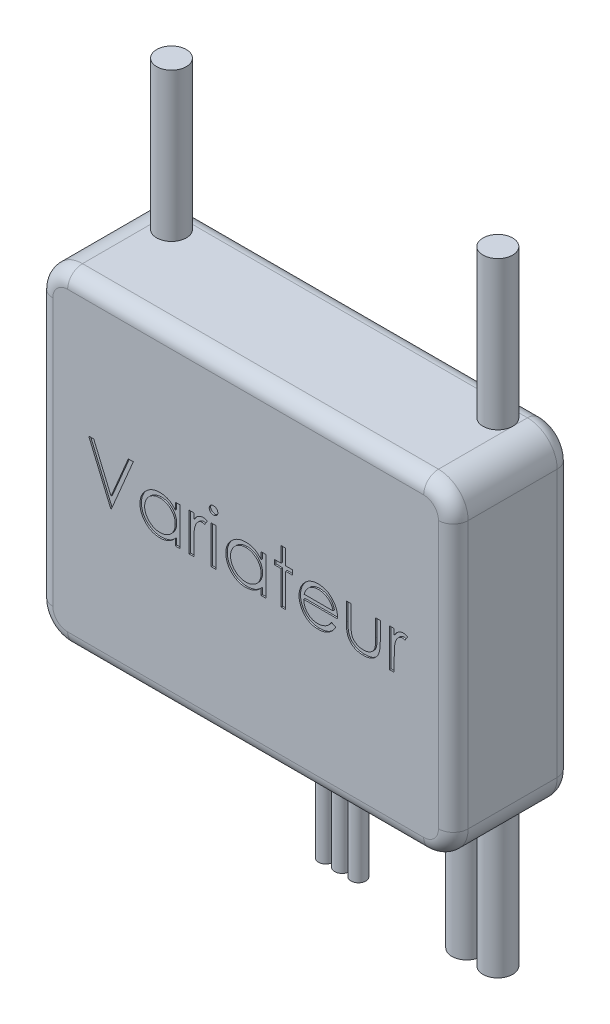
from build123d import *

# Parameters (mm, degrees)
EXTRUSION1_DEPTH        = 8
CONG_1_R                = 1
ESQUISSE2_W             = 0.314102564
ESQUISSE2_H             = 2.557692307
ENL_V_MAT_EXTRU_1_DEPTH = 0.1
ESQUISSE3_R             = 1
ESQUISSE3_R_2           = 0.5
EXTRUSION2_DEPTH        = 10
EXTRUSION3_START        = 10
ESQUISSE4_R             = 1
EXTRUSION3_DEPTH        = 10


with BuildPart() as part:
    # Esquisse1 → Extrusion1 (new body)
    with BuildSketch(Plane.XY):
        with BuildLine():
            Line((-12, 11), (12, 11))
            ThreePointArc((12, 11), (13.414213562, 10.414213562), (14, 9))
            Line((14, 9), (14, -9))
            ThreePointArc((14, -9), (13.414213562, -10.414213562), (12, -11))
            Line((12, -11), (-12, -11))
            ThreePointArc((-12, -11), (-13.414213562, -10.414213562), (-14, -9))
            Line((-14, -9), (-14, 9))
            ThreePointArc((-14, 9), (-13.414213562, 10.414213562), (-12, 11))
        make_face()
    extrude(amount=EXTRUSION1_DEPTH)

    # Cong_1
    cong_1_edges = [part.edges().sort_by_distance(p)[0] for p in [
        (-13.414213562, -10.414213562, 8),
        (0, -11, 8),
        (13.414213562, -10.414213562, 8),
        (14, 0, 8),
        (13.414213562, 10.414213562, 8),
        (0, 11, 8),
        (-13.414213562, 10.414213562, 8),
        (0, 11, 0),
        (-14, 0, 8),
        (13.414213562, 10.414213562, 0),
        (14, 0, 0),
        (13.414213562, -10.414213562, 0),
        (0, -11, 0),
        (-13.414213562, -10.414213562, 0),
        (-14, 0, 0),
        (-13.414213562, 10.414213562, 0),
    ]]
    fillet(cong_1_edges, radius=CONG_1_R)

    # Esquisse2 → Enl_v. mat.-Extru.1 (cut)
    # profile 1 of 10: a face of its own
    with BuildSketch(Plane.XY.offset(8)):
        Polygon((-10.58037848, 2.145396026), (-10.243840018, 2.145396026), (-9.077173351, -0.612817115), (-7.910506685, 2.145396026), (-7.573968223, 2.145396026), (-9.054737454, -1.354603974), (-9.099609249, -1.354603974), align=None)
    # profile 2 of 10: a face of its own
    with BuildSketch(Plane.XY.offset(8)):
        with BuildLine():
            Line((-4.432942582, 1.203088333), (-4.432942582, -1.354603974))
            Line((-4.432942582, -1.354603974), (-4.747045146, -1.354603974))
            Line((-4.747045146, -1.354603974), (-4.747045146, -0.912196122))
            add(Edge.make_bspline(
                [(-4.747045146, -0.912196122), (-4.782463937, -0.952235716), (-4.851584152, -1.030373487), (-4.96702527, -1.132455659), (-5.089393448, -1.216833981), (-5.218094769, -1.284983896), (-5.353013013, -1.336175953), (-5.4938491, -1.372562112), (-5.640660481, -1.395955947), (-5.740912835, -1.398291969), (-5.791716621, -1.399475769)],
                knots=[0, 0, 0, 0, 1.074387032, 2.096679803, 3.090159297, 4.057316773, 5.018401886, 5.985159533, 6.978961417, 8, 8, 8, 8], degree=3))
            add(Edge.make_bspline(
                [(-5.791716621, -1.399475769), (-5.836884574, -1.398249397), (-5.925957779, -1.395830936), (-6.056986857, -1.377068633), (-6.183079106, -1.346938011), (-6.304353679, -1.305037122), (-6.420025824, -1.2494563), (-6.531085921, -1.182915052), (-6.636958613, -1.103674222), (-6.736030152, -1.013086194), (-6.827262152, -0.914691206), (-6.907323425, -0.80974566), (-6.974076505, -0.698703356), (-7.029896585, -0.582970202), (-7.07289293, -0.461655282), (-7.102866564, -0.335178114), (-7.121607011, -0.203688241), (-7.124024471, -0.114148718), (-7.125250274, -0.068746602)],
                knots=[0, 0, 0, 0, 1.033919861, 2.038935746, 3.024066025, 3.998881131, 4.97069526, 5.957263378, 6.95902576, 7.993208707, 9.027059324, 10.027763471, 11.009749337, 11.988697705, 12.965288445, 13.950418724, 14.960734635, 16, 16, 16, 16], degree=3))
            add(Edge.make_bspline(
                [(-7.125250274, -0.068746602), (-7.123997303, -0.024282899), (-7.121520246, 0.063619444), (-7.103067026, 0.192898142), (-7.072036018, 0.317416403), (-7.02848817, 0.436773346), (-6.972646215, 0.551113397), (-6.904718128, 0.660517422), (-6.824699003, 0.765286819), (-6.732446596, 0.862958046), (-6.632511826, 0.95317866), (-6.525603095, 1.031587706), (-6.414379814, 1.099304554), (-6.297116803, 1.152958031), (-6.175549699, 1.196367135), (-6.048596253, 1.226400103), (-5.916784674, 1.244097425), (-5.827294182, 1.246660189), (-5.781900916, 1.247960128)],
                knots=[0, 0, 0, 0, 1.020392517, 2.01726096, 2.990465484, 3.961182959, 4.928053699, 5.906110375, 6.912531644, 7.948652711, 8.985773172, 9.998621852, 10.987621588, 11.969261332, 12.953316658, 13.946091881, 14.958173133, 16, 16, 16, 16], degree=3))
            add(Edge.make_bspline(
                [(-5.781900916, 1.247960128), (-5.729701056, 1.246522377), (-5.627339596, 1.243703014), (-5.477611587, 1.220240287), (-5.335967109, 1.180601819), (-5.201312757, 1.126684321), (-5.074132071, 1.055035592), (-4.955629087, 0.964655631), (-4.844563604, 0.856114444), (-4.780183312, 0.772744), (-4.747045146, 0.729831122)],
                knots=[0, 0, 0, 0, 1.038897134, 2.037228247, 3.008116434, 3.962042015, 4.918381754, 5.904844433, 6.921570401, 8, 8, 8, 8], degree=3))
            Line((-4.747045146, 0.729831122), (-4.747045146, 1.203088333))
            Line((-4.747045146, 1.203088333), (-4.432942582, 1.203088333))
        make_face()
        with BuildLine():
            add(Edge.make_bspline(
                [(-5.777694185, 0.933857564), (-5.823608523, 0.932223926), (-5.914236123, 0.928999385), (-6.047280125, 0.90382589), (-6.174593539, 0.861941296), (-6.295539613, 0.804659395), (-6.40820783, 0.732630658), (-6.5089015, 0.645509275), (-6.598444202, 0.545672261), (-6.673752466, 0.43357015), (-6.735142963, 0.313392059), (-6.778309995, 0.187767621), (-6.806779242, 0.058962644), (-6.809687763, -0.028400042), (-6.81114771, -0.072252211)],
                knots=[0, 0, 0, 0, 1.031046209, 2.035121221, 3.029706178, 4.034933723, 5.034054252, 6.02443088, 7.017295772, 8.038157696, 9.050218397, 10.03989886, 11.016116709, 12, 12, 12, 12], degree=3))
            add(Edge.make_bspline(
                [(-6.81114771, -0.072252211), (-6.809282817, -0.115842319), (-6.80556034, -0.202851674), (-6.778809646, -0.331832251), (-6.733929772, -0.457486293), (-6.67268771, -0.578747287), (-6.596001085, -0.691331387), (-6.507112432, -0.79307151), (-6.405162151, -0.880561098), (-6.292234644, -0.953798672), (-6.171626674, -1.012961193), (-6.044792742, -1.054126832), (-5.914117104, -1.080704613), (-5.82526477, -1.083809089), (-5.780498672, -1.085373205)],
                knots=[0, 0, 0, 0, 0.979072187, 1.954306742, 2.945804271, 3.96968567, 4.997920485, 5.998718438, 6.996577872, 8.005894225, 9.015743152, 10.005417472, 10.995077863, 12, 12, 12, 12], degree=3))
            add(Edge.make_bspline(
                [(-5.780498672, -1.085373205), (-5.735052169, -1.083713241), (-5.644663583, -1.080411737), (-5.511224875, -1.055130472), (-5.381729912, -1.013361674), (-5.257942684, -0.955462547), (-5.142626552, -0.883705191), (-5.039128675, -0.7996981), (-4.951612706, -0.701994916), (-4.877420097, -0.594618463), (-4.81924468, -0.476906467), (-4.776868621, -0.351572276), (-4.751814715, -0.218611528), (-4.748656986, -0.127747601), (-4.747045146, -0.081366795)],
                knots=[0, 0, 0, 0, 1.01762866, 2.023962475, 3.030623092, 4.058876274, 5.077231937, 6.066672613, 7.034107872, 8.005628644, 8.981990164, 9.965428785, 10.961468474, 12, 12, 12, 12], degree=3))
            add(Edge.make_bspline(
                [(-4.747045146, -0.081366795), (-4.748004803, -0.046028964), (-4.74989371, 0.023527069), (-4.76432428, 0.125654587), (-4.787279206, 0.223388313), (-4.819625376, 0.316831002), (-4.86211666, 0.405466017), (-4.913364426, 0.489929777), (-4.974269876, 0.569782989), (-5.043852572, 0.64392606), (-5.120017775, 0.711552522), (-5.200612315, 0.771916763), (-5.286591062, 0.821505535), (-5.376508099, 0.862546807), (-5.470519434, 0.895205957), (-5.569390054, 0.916993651), (-5.67206904, 0.931953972), (-5.742115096, 0.933216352), (-5.777694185, 0.933857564)],
                knots=[0, 0, 0, 0, 1.050140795, 2.067009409, 3.05949893, 4.030605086, 5.00011959, 5.97591094, 6.962425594, 7.979863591, 8.993523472, 9.986985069, 10.967611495, 11.937549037, 12.921786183, 13.919465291, 14.943216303, 16, 16, 16, 16], degree=3))
        make_face(mode=Mode.SUBTRACT)
    # profile 3 of 10: a face of its own
    with BuildSketch(Plane.XY.offset(8)):
        with BuildLine():
            Line((-3.804737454, 1.203088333), (-3.49063489, 1.203088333))
            Line((-3.49063489, 1.203088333), (-3.49063489, 0.82658593))
            add(Edge.make_bspline(
                [(-3.49063489, 0.82658593), (-3.467446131, 0.861641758), (-3.42309781, 0.928685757), (-3.349384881, 1.017355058), (-3.27388155, 1.090770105), (-3.196226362, 1.149273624), (-3.115848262, 1.193086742), (-3.034511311, 1.225179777), (-2.950935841, 1.244157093), (-2.894773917, 1.246690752), (-2.866636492, 1.247960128)],
                knots=[0, 0, 0, 0, 1.2804753, 2.448899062, 3.506932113, 4.484331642, 5.4025378, 6.288909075, 7.142734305, 8, 8, 8, 8], degree=3))
            add(Edge.make_bspline(
                [(-2.866636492, 1.247960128), (-2.844810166, 1.246769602), (-2.799901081, 1.244320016), (-2.731918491, 1.227109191), (-2.661875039, 1.199631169), (-2.616732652, 1.173790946), (-2.593198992, 1.160319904)],
                knots=[0, 0, 0, 0, 0.901110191, 1.854092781, 2.881294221, 4, 4, 4, 4], degree=3))
            Line((-2.593198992, 1.160319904), (-2.765674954, 0.888284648))
            add(Edge.make_bspline(
                [(-2.765674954, 0.888284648), (-2.780783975, 0.895024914), (-2.80946379, 0.907819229), (-2.851418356, 0.922961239), (-2.890099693, 0.931877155), (-2.914743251, 0.933227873), (-2.926231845, 0.933857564)],
                knots=[0, 0, 0, 0, 1.180555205, 2.24091978, 3.179933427, 4, 4, 4, 4], degree=3))
            add(Edge.make_bspline(
                [(-2.926231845, 0.933857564), (-2.951437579, 0.932177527), (-3.002849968, 0.928750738), (-3.078334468, 0.90181193), (-3.151581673, 0.85828669), (-3.209753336, 0.810015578), (-3.254795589, 0.76346778), (-3.286935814, 0.722819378), (-3.316418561, 0.677240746), (-3.344588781, 0.627511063), (-3.370255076, 0.572781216), (-3.394209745, 0.513598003), (-3.415868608, 0.449892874), (-3.428218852, 0.405510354), (-3.434545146, 0.382775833)],
                knots=[0, 0, 0, 0, 1.125678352, 2.296057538, 3.5422874, 4.923748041, 5.663163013, 6.437101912, 7.23742474, 8.08941207, 8.991984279, 9.93940061, 10.944477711, 12, 12, 12, 12], degree=3))
            add(Edge.make_bspline(
                [(-3.434545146, 0.382775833), (-3.43927754, 0.36249866), (-3.449759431, 0.317586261), (-3.459950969, 0.242237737), (-3.470020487, 0.153214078), (-3.477117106, 0.050267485), (-3.483695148, -0.066344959), (-3.48740523, -0.196800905), (-3.49050837, -0.341234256), (-3.490591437, -0.442208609), (-3.49063489, -0.495028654)],
                knots=[0, 0, 0, 0, 0.566838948, 1.255505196, 2.06880316, 3.007127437, 4.065329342, 5.249902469, 6.561414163, 8, 8, 8, 8], degree=3))
            Line((-3.49063489, -0.495028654), (-3.49063489, -1.354603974))
            Line((-3.49063489, -1.354603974), (-3.804737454, -1.354603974))
            Line((-3.804737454, -1.354603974), (-3.804737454, 1.203088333))
        make_face()
    # profile 4 of 10: a face of its own
    with BuildSketch(Plane.XY.offset(8)):
        with BuildLine():
            add(Edge.make_bspline(
                [(-2.168319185, 2.28001141), (-2.148827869, 2.279107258), (-2.110660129, 2.277336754), (-2.055466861, 2.262175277), (-2.005209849, 2.236475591), (-1.960632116, 2.201995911), (-1.92238023, 2.161446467), (-1.895599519, 2.114185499), (-1.878387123, 2.06312686), (-1.876308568, 2.027511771), (-1.875250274, 2.009378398)],
                knots=[0, 0, 0, 0, 1.055194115, 2.066272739, 3.074728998, 4.095836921, 5.109056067, 6.073838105, 7.019297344, 8, 8, 8, 8], degree=3))
            add(Edge.make_bspline(
                [(-1.875250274, 2.009378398), (-1.876332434, 1.991715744), (-1.878471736, 1.956798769), (-1.895586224, 1.906625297), (-1.922608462, 1.860021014), (-1.960607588, 1.819550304), (-2.005216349, 1.785089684), (-2.055465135, 1.759384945), (-2.110660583, 1.744224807), (-2.148828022, 1.742454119), (-2.168319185, 1.741549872)],
                knots=[0, 0, 0, 0, 0.96129708, 1.900370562, 2.859976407, 3.87933698, 4.906634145, 5.921202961, 6.938410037, 8, 8, 8, 8], degree=3))
            add(Edge.make_bspline(
                [(-2.168319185, 1.741549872), (-2.18758746, 1.742419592), (-2.22509064, 1.744112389), (-2.279457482, 1.759682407), (-2.329285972, 1.78509848), (-2.373950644, 1.819324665), (-2.411180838, 1.860269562), (-2.438279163, 1.906596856), (-2.455354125, 1.956806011), (-2.457498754, 1.991718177), (-2.458583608, 2.009378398)],
                knots=[0, 0, 0, 0, 1.054934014, 2.053291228, 3.073705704, 4.106921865, 5.123545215, 6.088680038, 7.033164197, 8, 8, 8, 8], degree=3))
            add(Edge.make_bspline(
                [(-2.458583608, 2.009378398), (-2.457522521, 2.027509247), (-2.45543848, 2.06311938), (-2.438266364, 2.114214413), (-2.411406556, 2.161195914), (-2.373925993, 2.202221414), (-2.329292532, 2.236466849), (-2.279455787, 2.26187783), (-2.225091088, 2.27744917), (-2.187587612, 2.279141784), (-2.168319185, 2.28001141)],
                knots=[0, 0, 0, 0, 0.98631895, 1.937192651, 2.907499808, 3.917963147, 4.944918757, 5.95915025, 6.951458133, 8, 8, 8, 8], degree=3))
        make_face()
    # profile 5 of 10: a face of its own
    with BuildSketch(Plane.XY.offset(8)):
        with Locations((-2.166916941, -0.07575782)):
            Rectangle(ESQUISSE2_W, ESQUISSE2_H)
    # profile 6 of 10: a face of its own
    with BuildSketch(Plane.XY.offset(8)):
        with BuildLine():
            Line((1.355518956, 1.203088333), (1.355518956, -1.354603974))
            Line((1.355518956, -1.354603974), (1.041416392, -1.354603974))
            Line((1.041416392, -1.354603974), (1.041416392, -0.912196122))
            add(Edge.make_bspline(
                [(1.041416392, -0.912196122), (1.005997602, -0.952235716), (0.936877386, -1.030373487), (0.821436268, -1.132455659), (0.69906809, -1.216833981), (0.570366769, -1.284983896), (0.435448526, -1.336175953), (0.294612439, -1.372562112), (0.147801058, -1.395955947), (0.047548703, -1.398291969), (-0.003255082, -1.399475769)],
                knots=[0, 0, 0, 0, 1.074387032, 2.096679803, 3.090159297, 4.057316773, 5.018401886, 5.985159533, 6.978961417, 8, 8, 8, 8], degree=3))
            add(Edge.make_bspline(
                [(-0.003255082, -1.399475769), (-0.048423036, -1.398249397), (-0.137496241, -1.395830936), (-0.268525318, -1.377068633), (-0.394617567, -1.346938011), (-0.51589214, -1.305037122), (-0.631564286, -1.2494563), (-0.742624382, -1.182915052), (-0.848497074, -1.103674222), (-0.947568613, -1.013086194), (-1.038800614, -0.914691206), (-1.118861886, -0.80974566), (-1.185614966, -0.698703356), (-1.241435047, -0.582970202), (-1.284431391, -0.461655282), (-1.314405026, -0.335178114), (-1.333145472, -0.203688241), (-1.335562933, -0.114148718), (-1.336788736, -0.068746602)],
                knots=[0, 0, 0, 0, 1.033919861, 2.038935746, 3.024066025, 3.998881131, 4.97069526, 5.957263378, 6.95902576, 7.993208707, 9.027059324, 10.027763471, 11.009749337, 11.988697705, 12.965288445, 13.950418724, 14.960734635, 16, 16, 16, 16], degree=3))
            add(Edge.make_bspline(
                [(-1.336788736, -0.068746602), (-1.335535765, -0.024282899), (-1.333058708, 0.063619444), (-1.314605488, 0.192898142), (-1.283574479, 0.317416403), (-1.240026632, 0.436773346), (-1.184184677, 0.551113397), (-1.11625659, 0.660517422), (-1.036237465, 0.765286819), (-0.943985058, 0.862958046), (-0.844050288, 0.95317866), (-0.737141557, 1.031587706), (-0.625918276, 1.099304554), (-0.508655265, 1.152958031), (-0.38708816, 1.196367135), (-0.260134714, 1.226400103), (-0.128323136, 1.244097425), (-0.038832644, 1.246660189), (0.006560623, 1.247960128)],
                knots=[0, 0, 0, 0, 1.020392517, 2.01726096, 2.990465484, 3.961182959, 4.928053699, 5.906110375, 6.912531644, 7.948652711, 8.985773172, 9.998621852, 10.987621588, 11.969261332, 12.953316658, 13.946091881, 14.958173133, 16, 16, 16, 16], degree=3))
            add(Edge.make_bspline(
                [(0.006560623, 1.247960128), (0.058760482, 1.246522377), (0.161121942, 1.243703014), (0.310849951, 1.220240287), (0.452494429, 1.180601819), (0.587148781, 1.126684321), (0.714329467, 1.055035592), (0.832832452, 0.964655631), (0.943897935, 0.856114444), (1.008278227, 0.772744), (1.041416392, 0.729831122)],
                knots=[0, 0, 0, 0, 1.038897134, 2.037228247, 3.008116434, 3.962042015, 4.918381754, 5.904844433, 6.921570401, 8, 8, 8, 8], degree=3))
            Line((1.041416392, 0.729831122), (1.041416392, 1.203088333))
            Line((1.041416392, 1.203088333), (1.355518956, 1.203088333))
        make_face()
        with BuildLine():
            add(Edge.make_bspline(
                [(0.010767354, 0.933857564), (-0.035146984, 0.932223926), (-0.125774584, 0.928999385), (-0.258818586, 0.90382589), (-0.386132, 0.861941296), (-0.507078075, 0.804659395), (-0.619746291, 0.732630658), (-0.720439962, 0.645509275), (-0.809982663, 0.545672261), (-0.885290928, 0.43357015), (-0.946681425, 0.313392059), (-0.989848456, 0.187767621), (-1.018317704, 0.058962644), (-1.021226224, -0.028400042), (-1.022686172, -0.072252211)],
                knots=[0, 0, 0, 0, 1.031046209, 2.035121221, 3.029706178, 4.034933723, 5.034054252, 6.02443088, 7.017295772, 8.038157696, 9.050218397, 10.03989886, 11.016116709, 12, 12, 12, 12], degree=3))
            add(Edge.make_bspline(
                [(-1.022686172, -0.072252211), (-1.020821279, -0.115842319), (-1.017098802, -0.202851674), (-0.990348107, -0.331832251), (-0.945468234, -0.457486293), (-0.884226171, -0.578747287), (-0.807539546, -0.691331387), (-0.718650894, -0.79307151), (-0.616700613, -0.880561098), (-0.503773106, -0.953798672), (-0.383165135, -1.012961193), (-0.256331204, -1.054126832), (-0.125655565, -1.080704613), (-0.036803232, -1.083809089), (0.007962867, -1.085373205)],
                knots=[0, 0, 0, 0, 0.979072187, 1.954306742, 2.945804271, 3.96968567, 4.997920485, 5.998718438, 6.996577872, 8.005894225, 9.015743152, 10.005417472, 10.995077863, 12, 12, 12, 12], degree=3))
            add(Edge.make_bspline(
                [(0.007962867, -1.085373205), (0.053409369, -1.083713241), (0.143797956, -1.080411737), (0.277236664, -1.055130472), (0.406731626, -1.013361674), (0.530518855, -0.955462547), (0.645834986, -0.883705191), (0.749332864, -0.7996981), (0.836848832, -0.701994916), (0.911041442, -0.594618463), (0.969216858, -0.476906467), (1.011592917, -0.351572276), (1.036646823, -0.218611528), (1.039804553, -0.127747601), (1.041416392, -0.081366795)],
                knots=[0, 0, 0, 0, 1.01762866, 2.023962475, 3.030623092, 4.058876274, 5.077231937, 6.066672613, 7.034107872, 8.005628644, 8.981990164, 9.965428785, 10.961468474, 12, 12, 12, 12], degree=3))
            add(Edge.make_bspline(
                [(1.041416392, -0.081366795), (1.040456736, -0.046028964), (1.038567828, 0.023527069), (1.024137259, 0.125654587), (1.001182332, 0.223388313), (0.968836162, 0.316831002), (0.926344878, 0.405466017), (0.875097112, 0.489929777), (0.814191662, 0.569782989), (0.744608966, 0.64392606), (0.668443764, 0.711552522), (0.587849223, 0.771916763), (0.501870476, 0.821505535), (0.411953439, 0.862546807), (0.317942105, 0.895205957), (0.219071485, 0.916993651), (0.116392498, 0.931953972), (0.046346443, 0.933216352), (0.010767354, 0.933857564)],
                knots=[0, 0, 0, 0, 1.050140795, 2.067009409, 3.05949893, 4.030605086, 5.00011959, 5.97591094, 6.962425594, 7.979863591, 8.993523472, 9.986985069, 10.967611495, 11.937549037, 12.921786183, 13.919465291, 14.943216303, 16, 16, 16, 16], degree=3))
        make_face(mode=Mode.SUBTRACT)
    # profile 7 of 10: a face of its own
    with BuildSketch(Plane.XY.offset(8)):
        Polygon((2.387570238, 2.235139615), (2.701672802, 2.235139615), (2.701672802, 1.203088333), (3.150390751, 1.203088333), (3.150390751, 0.888985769), (2.701672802, 0.888985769), (2.701672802, -1.354603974), (2.387570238, -1.354603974), (2.387570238, 0.888985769), (1.93885229, 0.888985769), (1.93885229, 1.203088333), (2.387570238, 1.203088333), align=None)
    # profile 8 of 10: a face of its own
    with BuildSketch(Plane.XY.offset(8)):
        with BuildLine():
            Line((5.788010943, -0.546911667), (6.067057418, -0.693446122))
            add(Edge.make_bspline(
                [(6.067057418, -0.693446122), (6.044820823, -0.732889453), (6.001557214, -0.809630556), (5.927156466, -0.915062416), (5.849164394, -1.009910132), (5.764060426, -1.091639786), (5.674390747, -1.162891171), (5.579658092, -1.225228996), (5.479369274, -1.278347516), (5.373519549, -1.323100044), (5.261219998, -1.357509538), (5.142198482, -1.381813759), (5.016226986, -1.396837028), (4.929880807, -1.398582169), (4.885667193, -1.399475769)],
                knots=[0, 0, 0, 0, 1.120438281, 2.179929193, 3.190490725, 4.156257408, 5.095198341, 6.022838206, 6.959905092, 7.901321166, 8.864066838, 9.862729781, 10.905609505, 12, 12, 12, 12], degree=3))
            add(Edge.make_bspline(
                [(4.885667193, -1.399475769), (4.836525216, -1.398328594), (4.740663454, -1.396090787), (4.601123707, -1.376798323), (4.469744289, -1.345325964), (4.346532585, -1.301360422), (4.231790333, -1.243933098), (4.125289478, -1.173973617), (4.026469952, -1.091841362), (3.938445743, -0.996824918), (3.85920186, -0.895142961), (3.78927604, -0.789187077), (3.730818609, -0.679223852), (3.683265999, -0.565953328), (3.644861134, -0.450089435), (3.61809443, -0.330577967), (3.602664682, -0.207742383), (3.600300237, -0.124645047), (3.5991087, -0.082769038)],
                knots=[0, 0, 0, 0, 1.145258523, 2.234067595, 3.276747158, 4.290159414, 5.277019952, 6.260822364, 7.254936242, 8.264827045, 9.274100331, 10.257902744, 11.220704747, 12.172965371, 13.118907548, 14.062713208, 15.023725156, 16, 16, 16, 16], degree=3))
            add(Edge.make_bspline(
                [(3.5991087, -0.082769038), (3.600167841, -0.043474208), (3.602266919, 0.034402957), (3.615497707, 0.149668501), (3.638946, 0.261696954), (3.671122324, 0.370581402), (3.71267357, 0.476139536), (3.763505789, 0.578435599), (3.823698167, 0.677360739), (3.870170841, 0.739763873), (3.893579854, 0.771197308)],
                knots=[0, 0, 0, 0, 1.024358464, 2.0301432, 3.019427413, 4.004406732, 4.986367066, 5.972626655, 6.978780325, 8, 8, 8, 8], degree=3))
            add(Edge.make_bspline(
                [(3.893579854, 0.771197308), (3.925287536, 0.809066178), (3.987698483, 0.883604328), (4.093254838, 0.981542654), (4.207555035, 1.063586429), (4.329166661, 1.131593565), (4.459503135, 1.183267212), (4.596812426, 1.221774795), (4.742658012, 1.243352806), (4.842363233, 1.246400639), (4.893379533, 1.247960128)],
                knots=[0, 0, 0, 0, 1.030682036, 2.02871468, 2.997146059, 3.962720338, 4.930598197, 5.918074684, 6.934738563, 8, 8, 8, 8], degree=3))
            add(Edge.make_bspline(
                [(4.893379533, 1.247960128), (4.945827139, 1.246606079), (5.048717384, 1.243949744), (5.198749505, 1.219323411), (5.340710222, 1.180270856), (5.474542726, 1.125117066), (5.600260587, 1.053957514), (5.717046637, 0.965815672), (5.826898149, 0.863397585), (5.890806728, 0.784634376), (5.92332745, 0.74455468)],
                knots=[0, 0, 0, 0, 1.056321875, 2.072262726, 3.055038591, 4.01806755, 4.982017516, 5.957941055, 6.960871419, 8, 8, 8, 8], degree=3))
            add(Edge.make_bspline(
                [(5.92332745, 0.74455468), (5.945454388, 0.714351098), (5.989560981, 0.65414498), (6.044808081, 0.555973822), (6.092765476, 0.453263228), (6.131098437, 0.344352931), (6.162137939, 0.230533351), (6.184594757, 0.110990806), (6.197764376, -0.014239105), (6.200353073, -0.099565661), (6.201672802, -0.143065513)],
                knots=[0, 0, 0, 0, 0.94817472, 1.890038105, 2.849395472, 3.817997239, 4.812318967, 5.836947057, 6.897266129, 8, 8, 8, 8], degree=3))
            Line((6.201672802, -0.143065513), (3.913211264, -0.143065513))
            add(Edge.make_bspline(
                [(3.913211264, -0.143065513), (3.91475087, -0.176765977), (3.917778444, -0.243036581), (3.931893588, -0.340007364), (3.954142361, -0.432380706), (3.985411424, -0.519463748), (4.023278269, -0.602393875), (4.069663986, -0.680555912), (4.12500354, -0.753593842), (4.186729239, -0.82216098), (4.255436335, -0.883221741), (4.327719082, -0.937873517), (4.404612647, -0.983679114), (4.48551073, -1.020859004), (4.570282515, -1.04996532), (4.658954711, -1.069833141), (4.751352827, -1.083140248), (4.814338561, -1.084619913), (4.846404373, -1.085373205)],
                knots=[0, 0, 0, 0, 1.094153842, 2.151609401, 3.174256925, 4.172055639, 5.149267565, 6.128595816, 7.11444997, 8.118368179, 9.117203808, 10.09244225, 11.054858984, 12.015122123, 12.976791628, 13.957293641, 14.960065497, 16, 16, 16, 16], degree=3))
            add(Edge.make_bspline(
                [(4.846404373, -1.085373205), (4.877755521, -1.084765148), (4.939962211, -1.083558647), (5.032603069, -1.071826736), (5.123742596, -1.052856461), (5.213003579, -1.026966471), (5.298574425, -0.995389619), (5.377819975, -0.957286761), (5.450700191, -0.915137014), (5.518817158, -0.866927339), (5.584888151, -0.807919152), (5.650430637, -0.734283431), (5.720707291, -0.647195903), (5.764696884, -0.581650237), (5.788010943, -0.546911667)],
                knots=[0, 0, 0, 0, 0.99110716, 1.966546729, 2.947904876, 3.932708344, 4.903319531, 5.828989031, 6.710028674, 7.56322171, 8.463672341, 9.504779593, 10.677557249, 12, 12, 12, 12], degree=3))
        make_face()
        with BuildLine():
            add(Edge.make_bspline(
                [(5.887570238, 0.171037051), (5.876073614, 0.212699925), (5.853946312, 0.292887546), (5.807709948, 0.403928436), (5.755638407, 0.502616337), (5.694016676, 0.58819597), (5.62419795, 0.664199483), (5.543552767, 0.730618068), (5.453116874, 0.790035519), (5.353357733, 0.840188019), (5.247715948, 0.882877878), (5.137109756, 0.911502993), (5.024251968, 0.931112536), (4.947917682, 0.932938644), (4.909505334, 0.933857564)],
                knots=[0, 0, 0, 0, 1.154881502, 2.222775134, 3.210006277, 4.132804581, 5.035138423, 5.962687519, 6.919655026, 7.923214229, 8.944639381, 9.960483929, 10.97369054, 12, 12, 12, 12], degree=3))
            add(Edge.make_bspline(
                [(4.909505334, 0.933857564), (4.878155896, 0.933245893), (4.816184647, 0.932036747), (4.724883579, 0.920566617), (4.63720388, 0.901606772), (4.552498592, 0.875641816), (4.471877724, 0.841033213), (4.393682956, 0.800449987), (4.319902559, 0.750908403), (4.273761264, 0.713149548), (4.250450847, 0.69407391)],
                knots=[0, 0, 0, 0, 1.04873581, 2.073130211, 3.073294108, 4.04793562, 5.032784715, 6.005352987, 6.992311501, 8, 8, 8, 8], degree=3))
            add(Edge.make_bspline(
                [(4.250450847, 0.69407391), (4.233757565, 0.678979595), (4.199974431, 0.648432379), (4.15483391, 0.595803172), (4.111613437, 0.53905161), (4.072279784, 0.476006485), (4.036202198, 0.407385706), (4.002442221, 0.333768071), (3.972055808, 0.254594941), (3.954959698, 0.199422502), (3.946163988, 0.171037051)],
                knots=[0, 0, 0, 0, 0.879870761, 1.780643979, 2.707998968, 3.669668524, 4.684282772, 5.740141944, 6.837334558, 8, 8, 8, 8], degree=3))
            Line((3.946163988, 0.171037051), (5.887570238, 0.171037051))
        make_face(mode=Mode.SUBTRACT)
    # profile 9 of 10: a face of its own
    with BuildSketch(Plane.XY.offset(8)):
        with BuildLine():
            Line((6.785006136, 1.203088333), (7.0991087, 1.203088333))
            Line((7.0991087, 1.203088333), (7.0991087, 0.016790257))
            add(Edge.make_bspline(
                [(7.0991087, 0.016790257), (7.099250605, -0.018032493), (7.099522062, -0.084646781), (7.101363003, -0.180501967), (7.105693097, -0.26791868), (7.111106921, -0.346947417), (7.118069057, -0.417574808), (7.126352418, -0.479554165), (7.13561084, -0.53358835), (7.144673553, -0.566131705), (7.148888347, -0.581266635)],
                knots=[0, 0, 0, 0, 1.388932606, 2.656963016, 3.823490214, 4.879454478, 5.816252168, 6.653371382, 7.373723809, 8, 8, 8, 8], degree=3))
            add(Edge.make_bspline(
                [(7.148888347, -0.581266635), (7.155649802, -0.600289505), (7.169032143, -0.637939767), (7.193305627, -0.692328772), (7.223333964, -0.742704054), (7.256193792, -0.791008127), (7.294093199, -0.835810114), (7.33655267, -0.877034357), (7.382150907, -0.916238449), (7.449905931, -0.962623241), (7.542565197, -1.012338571), (7.664217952, -1.055234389), (7.796122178, -1.080870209), (7.887286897, -1.083844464), (7.934144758, -1.085373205)],
                knots=[0, 0, 0, 0, 0.725840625, 1.436591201, 2.137033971, 2.831655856, 3.53531722, 4.242432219, 4.957935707, 5.694543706, 7.190802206, 8.724350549, 10.316345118, 12, 12, 12, 12], degree=3))
            add(Edge.make_bspline(
                [(7.934144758, -1.085373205), (7.980998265, -1.083811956), (8.071651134, -1.080791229), (8.202106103, -1.056007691), (8.321357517, -1.014602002), (8.428208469, -0.95679459), (8.522174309, -0.886052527), (8.600478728, -0.803043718), (8.665085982, -0.710394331), (8.693295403, -0.641270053), (8.707482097, -0.606507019)],
                knots=[0, 0, 0, 0, 1.157059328, 2.238695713, 3.266970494, 4.264342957, 5.228770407, 6.160125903, 7.074715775, 8, 8, 8, 8], degree=3))
            add(Edge.make_bspline(
                [(8.707482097, -0.606507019), (8.711676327, -0.59254072), (8.720948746, -0.561664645), (8.730911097, -0.509284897), (8.739885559, -0.446820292), (8.747548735, -0.373862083), (8.753013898, -0.290600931), (8.755959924, -0.197062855), (8.759288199, -0.093541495), (8.759338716, -0.021073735), (8.75936511, 0.016790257)],
                knots=[0, 0, 0, 0, 0.557542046, 1.232589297, 2.036731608, 2.971723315, 4.038036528, 5.22795436, 6.551621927, 8, 8, 8, 8], degree=3))
            Line((8.75936511, 0.016790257), (8.75936511, 1.203088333))
            Line((8.75936511, 1.203088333), (9.073467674, 1.203088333))
            Line((9.073467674, 1.203088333), (9.073467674, -0.042103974))
            add(Edge.make_bspline(
                [(9.073467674, -0.042103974), (9.073025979, -0.084411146), (9.072169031, -0.166492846), (9.066661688, -0.285776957), (9.057212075, -0.396939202), (9.04286939, -0.500038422), (9.026003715, -0.594995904), (9.004247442, -0.68193335), (8.978269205, -0.760582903), (8.94896369, -0.83232468), (8.914341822, -0.897371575), (8.877514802, -0.959107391), (8.83499003, -1.016000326), (8.790219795, -1.070882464), (8.74041814, -1.121023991), (8.686518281, -1.167575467), (8.629278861, -1.211248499), (8.567429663, -1.250339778), (8.5018736, -1.285556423), (8.432529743, -1.316772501), (8.358548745, -1.341475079), (8.280885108, -1.362785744), (8.199158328, -1.379500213), (8.113447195, -1.39128678), (8.023780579, -1.398512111), (7.962671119, -1.399149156), (7.93134027, -1.399475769)],
                knots=[0, 0, 0, 0, 1.493040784, 2.896703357, 4.213163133, 5.428574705, 6.569057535, 7.615249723, 8.588095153, 9.490268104, 10.346124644, 11.18633936, 12.024365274, 12.850166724, 13.684164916, 14.514361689, 15.362232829, 16.222528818, 17.093394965, 17.986930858, 18.902426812, 19.842810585, 20.827885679, 21.843828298, 22.894529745, 24, 24, 24, 24], degree=3))
            add(Edge.make_bspline(
                [(7.93134027, -1.399475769), (7.900243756, -1.399136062), (7.839136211, -1.398468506), (7.749464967, -1.391326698), (7.663516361, -1.379518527), (7.581595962, -1.36266331), (7.503621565, -1.34162424), (7.429277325, -1.316620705), (7.359433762, -1.285540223), (7.293251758, -1.250562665), (7.23124937, -1.21099739), (7.173140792, -1.16762935), (7.119003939, -1.120523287), (7.068826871, -1.06987593), (7.023313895, -1.015058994), (6.981897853, -0.956513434), (6.943941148, -0.894819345), (6.909588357, -0.828756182), (6.880076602, -0.756184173), (6.854021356, -0.675887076), (6.832710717, -0.586984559), (6.815368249, -0.48955263), (6.801416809, -0.384057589), (6.791730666, -0.269889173), (6.786314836, -0.147325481), (6.785451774, -0.062675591), (6.785006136, -0.018966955)],
                knots=[0, 0, 0, 0, 1.083640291, 2.129454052, 3.13281866, 4.105697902, 5.042300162, 5.946461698, 6.836384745, 7.703652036, 8.553297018, 9.397182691, 10.228592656, 11.052265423, 11.879314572, 12.708807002, 13.549817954, 14.402308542, 15.300838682, 16.27712199, 17.341985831, 18.484375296, 19.725102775, 21.0496083, 22.476576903, 24, 24, 24, 24], degree=3))
            Line((6.785006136, -0.018966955), (6.785006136, 1.203088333))
        make_face()
    # profile 10 of 10: a face of its own
    with BuildSketch(Plane.XY.offset(8)):
        with BuildLine():
            Line((9.701672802, 1.203088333), (10.015775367, 1.203088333))
            Line((10.015775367, 1.203088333), (10.015775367, 0.82658593))
            add(Edge.make_bspline(
                [(10.015775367, 0.82658593), (10.038964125, 0.861641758), (10.083312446, 0.928685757), (10.157025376, 1.017355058), (10.232528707, 1.090770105), (10.310183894, 1.149273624), (10.390561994, 1.193086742), (10.471898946, 1.225179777), (10.555474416, 1.244157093), (10.61163634, 1.246690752), (10.639773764, 1.247960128)],
                knots=[0, 0, 0, 0, 1.2804753, 2.448899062, 3.506932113, 4.484331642, 5.4025378, 6.288909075, 7.142734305, 8, 8, 8, 8], degree=3))
            add(Edge.make_bspline(
                [(10.639773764, 1.247960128), (10.66160009, 1.246769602), (10.706509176, 1.244320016), (10.774491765, 1.227109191), (10.844535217, 1.199631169), (10.889677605, 1.173790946), (10.913211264, 1.160319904)],
                knots=[0, 0, 0, 0, 0.901110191, 1.854092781, 2.881294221, 4, 4, 4, 4], degree=3))
            Line((10.913211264, 1.160319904), (10.740735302, 0.888284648))
            add(Edge.make_bspline(
                [(10.740735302, 0.888284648), (10.725626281, 0.895024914), (10.696946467, 0.907819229), (10.6549919, 0.922961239), (10.616310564, 0.931877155), (10.591667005, 0.933227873), (10.580178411, 0.933857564)],
                knots=[0, 0, 0, 0, 1.180555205, 2.24091978, 3.179933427, 4, 4, 4, 4], degree=3))
            add(Edge.make_bspline(
                [(10.580178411, 0.933857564), (10.554972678, 0.932177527), (10.503560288, 0.928750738), (10.428075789, 0.90181193), (10.354828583, 0.85828669), (10.296656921, 0.810015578), (10.251614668, 0.76346778), (10.219474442, 0.722819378), (10.189991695, 0.677240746), (10.161821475, 0.627511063), (10.136155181, 0.572781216), (10.112200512, 0.513598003), (10.090541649, 0.449892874), (10.078191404, 0.405510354), (10.07186511, 0.382775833)],
                knots=[0, 0, 0, 0, 1.125678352, 2.296057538, 3.5422874, 4.923748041, 5.663163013, 6.437101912, 7.23742474, 8.08941207, 8.991984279, 9.93940061, 10.944477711, 12, 12, 12, 12], degree=3))
            add(Edge.make_bspline(
                [(10.07186511, 0.382775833), (10.067132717, 0.36249866), (10.056650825, 0.317586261), (10.046459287, 0.242237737), (10.036389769, 0.153214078), (10.029293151, 0.050267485), (10.022715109, -0.066344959), (10.019005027, -0.196800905), (10.015901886, -0.341234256), (10.015818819, -0.442208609), (10.015775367, -0.495028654)],
                knots=[0, 0, 0, 0, 0.566838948, 1.255505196, 2.06880316, 3.007127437, 4.065329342, 5.249902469, 6.561414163, 8, 8, 8, 8], degree=3))
            Line((10.015775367, -0.495028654), (10.015775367, -1.354603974))
            Line((10.015775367, -1.354603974), (9.701672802, -1.354603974))
            Line((9.701672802, -1.354603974), (9.701672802, 1.203088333))
        make_face()
    extrude(amount=-ENL_V_MAT_EXTRU_1_DEPTH, mode=Mode.SUBTRACT)

    # Esquisse3 → Extrusion2 (add)
    with BuildSketch(Plane.XZ.offset(11)):
        with Locations(Location((11, 2, 0), (0, 0, 270))):
            Circle(ESQUISSE3_R)
        with Locations(Location((8.9, 2, 0), (0, 0, 270))):
            Circle(ESQUISSE3_R)
        with Locations(Location((-1.1, 1.5, 0), (0, 0, 270))):
            Circle(ESQUISSE3_R_2)
        with Locations(Location((0, 1.5, 0), (0, 0, 270))):
            Circle(ESQUISSE3_R_2)
        with Locations(Location((1.1, 1.5, 0), (0, 0, 270))):
            Circle(ESQUISSE3_R_2)
    extrude(amount=EXTRUSION2_DEPTH)

    # Esquisse4 → Extrusion3 (add)
    with BuildSketch(Plane(origin=(0, 11, 0), x_dir=(-1, 0, 0), z_dir=(0, 1, 0)).offset(EXTRUSION3_START)):
        with Locations(Location((-11, 2, 0), (0, 0, 270))):
            Circle(ESQUISSE4_R)
        with Locations(Location((11, 2, 0), (0, 0, 270))):
            Circle(ESQUISSE4_R)
    extrude(amount=-EXTRUSION3_DEPTH)


solid = part.part
